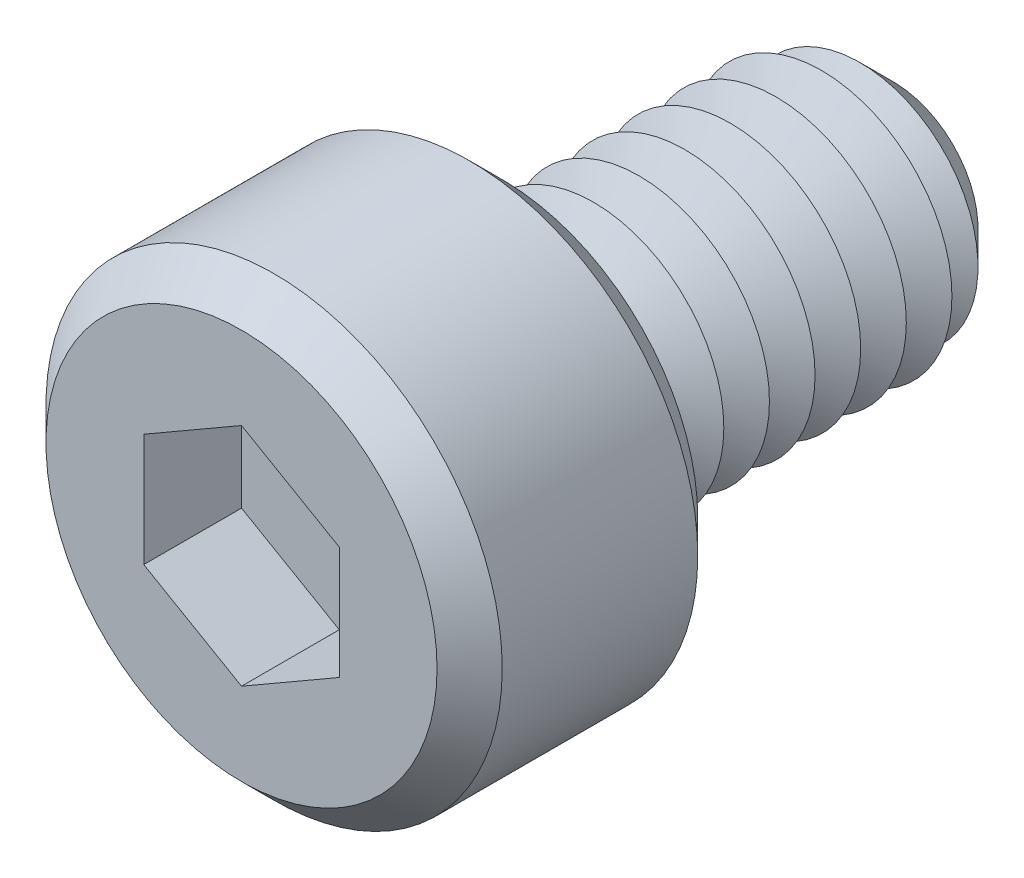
from build123d import *

# Parameters (mm, degrees)
SKETCH1_R           = 3.5
BOSS_EXTRUDE1_DEPTH = 4
SKETCH2_R           = 2
BOSS_EXTRUDE2_DEPTH = 6
CHAMFER1_SIZE       = 0.7
LPATTERN1_COUNT     = 8
LPATTERN1_PITCH     = 0.7
CUT_EXTRUDE1_DEPTH  = 1.5
SKETCH6_R           = 0.5
CUT_EXTRUDE2_DEPTH  = 8.5
CHAMFER2_SIZE       = 0.5


with BuildPart() as part:
    # Sketch1 → Boss-Extrude1 (new body)
    with BuildSketch(Plane.XY):
        Circle(SKETCH1_R)
    extrude(amount=BOSS_EXTRUDE1_DEPTH)

    # Sketch2 → Boss-Extrude2 (add)
    with BuildSketch(Plane(origin=(0, 0, 0), x_dir=(-1, 0, 0), z_dir=(0, 0, -1))):
        Circle(SKETCH2_R)
    extrude(amount=BOSS_EXTRUDE2_DEPTH)

    # Chamfer1
    chamfer1_edges = [part.edges().sort_by_distance(p)[0] for p in [
        (2, 0, -6),
    ]]
    chamfer(chamfer1_edges, length=CHAMFER1_SIZE)

    # Sketch4 → Cut-Revolve1 (revolve, cut)
    with BuildSketch(Plane(origin=(0, 0, 0), x_dir=(0, 0, -1), z_dir=(1, 0, 0)), mode=Mode.PRIVATE) as cut_revolve1_sk:
        Polygon((0, 2), (0.35, 1.393782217), (0.7, 2), align=None)
    cut_revolve1 = revolve(cut_revolve1_sk.sketch.rotate(Axis((0, 0, 2.512122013), (0, 0, -1)), 90), axis=Axis((0, 0, 2.512122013), (0, 0, -1)), mode=Mode.SUBTRACT)

    # LPattern1: Cut-Revolve1 ×8
    with Locations(*[(0, 0, -i * LPATTERN1_PITCH) for i in range(1, LPATTERN1_COUNT)]):
        add(cut_revolve1, mode=Mode.SUBTRACT)

    # Sketch5 → Cut-Extrude1 (cut)
    with BuildSketch(Plane.XY.offset(4)):
        Polygon((0, 1.732050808), (-1.5, 0.866025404), (-1.5, -0.866025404), (0, -1.732050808), (1.5, -0.866025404), (1.5, 0.866025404), align=None)
    extrude(amount=-CUT_EXTRUDE1_DEPTH, mode=Mode.SUBTRACT)

    # Sketch6 → Cut-Extrude2 (cut)
    with BuildSketch(Plane.XY.offset(2.5)):
        Circle(SKETCH6_R)
    extrude(amount=-CUT_EXTRUDE2_DEPTH, mode=Mode.SUBTRACT)

    # Chamfer2
    chamfer2_edges = [part.edges().sort_by_distance(p)[0] for p in [
        (-3.5, 0, 0),
        (-3.5, 0, 4),
    ]]
    chamfer(chamfer2_edges, length=CHAMFER2_SIZE)


solid = part.part
